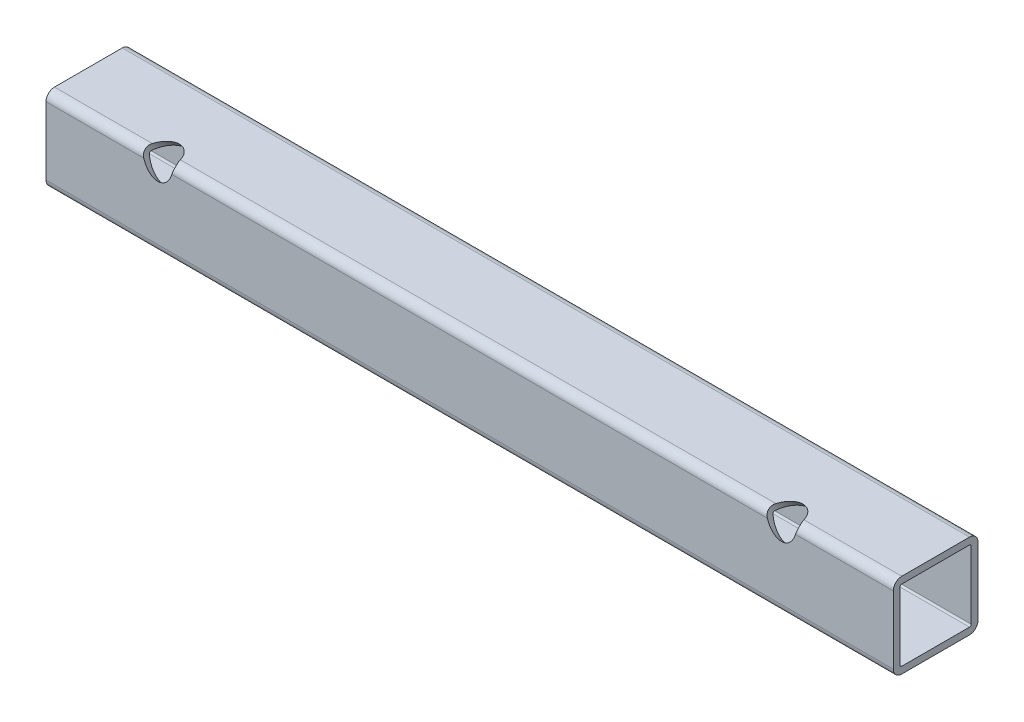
from build123d import *

# Parameters (mm, degrees)
BOSS_EXTRU_1_DEPTH      = 125
ENL_V_MAT_EXTRU_1_REACH = 131.626
ESQUISSE3_R             = 4.5


with BuildPart() as part:
    # Esquisse1 → Boss.-Extru.1 (new, symmetric)
    with BuildSketch(Plane(origin=(0, 0, 0), x_dir=(0, 0, -1), z_dir=(1, 0, 0))):
        with BuildLine():
            Line((-10, 12.5), (10, 12.5))
            ThreePointArc((10, 12.5), (11.767766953, 11.767766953), (12.5, 10))
            Line((12.5, 10), (12.5, -10))
            ThreePointArc((12.5, -10), (11.767766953, -11.767766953), (10, -12.5))
            Line((10, -12.5), (-10, -12.5))
            ThreePointArc((-10, -12.5), (-11.767766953, -11.767766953), (-12.5, -10))
            Line((-12.5, -10), (-12.5, 10))
            ThreePointArc((-12.5, 10), (-11.767766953, 11.767766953), (-10, 12.5))
        make_face()
        with BuildLine():
            Line((-10, 10.5), (10, 10.5))
            ThreePointArc((10, 10.5), (10.353553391, 10.353553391), (10.5, 10))
            Line((10.5, 10), (10.5, -10))
            ThreePointArc((10.5, -10), (10.353553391, -10.353553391), (10, -10.5))
            Line((10, -10.5), (-10, -10.5))
            ThreePointArc((-10, -10.5), (-10.353553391, -10.353553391), (-10.5, -10))
            Line((-10.5, -10), (-10.5, 10))
            ThreePointArc((-10.5, 10), (-10.353553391, 10.353553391), (-10, 10.5))
        make_face(mode=Mode.SUBTRACT)
    extrude(amount=BOSS_EXTRU_1_DEPTH, both=True)

    # Esquisse3 → Enl_v. mat.-Extru.1 (cut, up to next)
    with BuildSketch(Plane(origin=(0, 11.767766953, 11.767766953), x_dir=(-1, 0, 0), z_dir=(0, 0.7071067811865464, 0.7071067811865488)), mode=Mode.PRIVATE) as enl_v_mat_extru_1_sk1:
        with Locations(Location((-92, 0, 0), (0, 0, 23.131147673))):
            Circle(ESQUISSE3_R)
    enl_v_mat_extru_1_tool1 = extrude(enl_v_mat_extru_1_sk1.sketch, amount=-ENL_V_MAT_EXTRU_1_REACH, mode=Mode.PRIVATE) & part.part
    # Esquisse3 → Enl_v. mat.-Extru.1 (cut, up to next)
    with BuildSketch(Plane(origin=(0, 11.767766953, 11.767766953), x_dir=(-1, 0, 0), z_dir=(0, 0.7071067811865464, 0.7071067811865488)), mode=Mode.PRIVATE) as enl_v_mat_extru_1_sk2:
        with Locations(Location((92, 0, 0), (0, 0, 156.868852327))):
            Circle(ESQUISSE3_R)
    enl_v_mat_extru_1_tool2 = extrude(enl_v_mat_extru_1_sk2.sketch, amount=-ENL_V_MAT_EXTRU_1_REACH, mode=Mode.PRIVATE) & part.part
    add(enl_v_mat_extru_1_tool1.solids().sort_by_distance((92, 11.767767, 11.767767))[0], mode=Mode.SUBTRACT)
    add(enl_v_mat_extru_1_tool2.solids().sort_by_distance((-92, 11.767767, 11.767767))[0], mode=Mode.SUBTRACT)


solid = part.part
